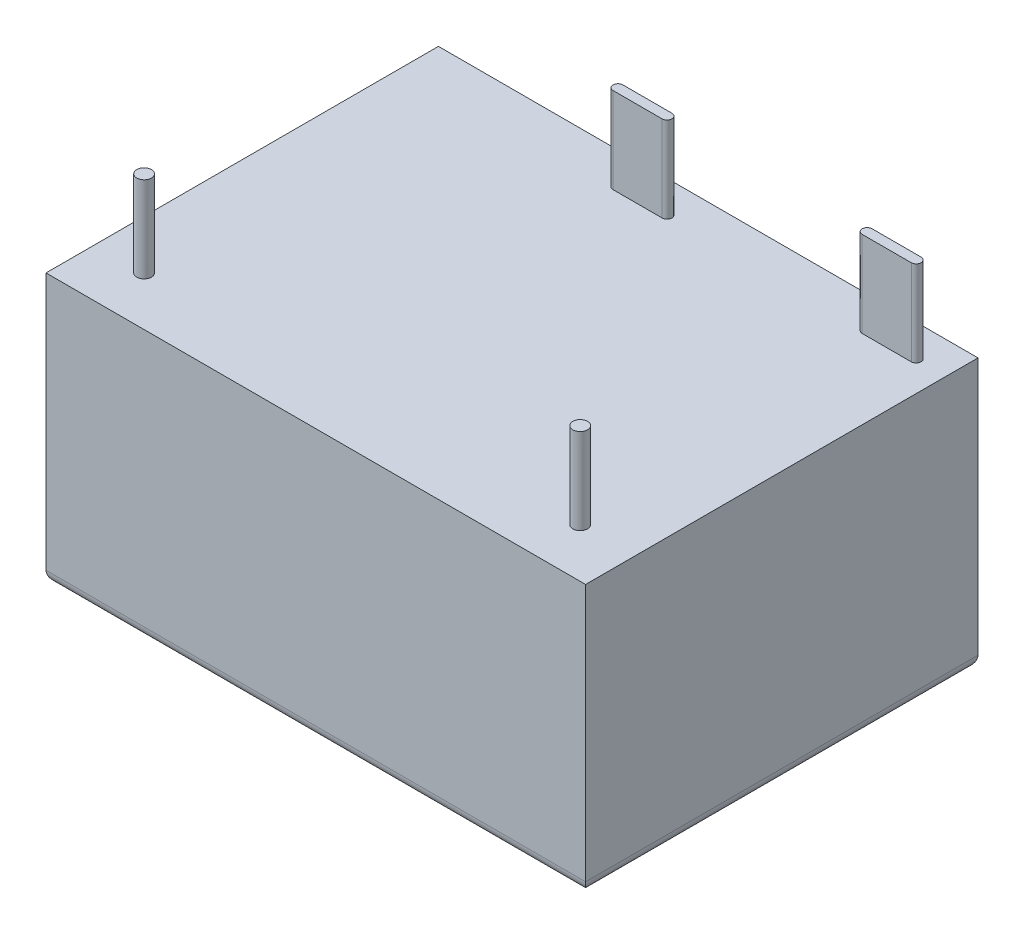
from build123d import *

# Parameters (mm, degrees)
SKETCH2_W           = 22
SKETCH2_H           = 16
BOSS_EXTRUDE1_DEPTH = 11
SKETCH3_R           = 0.3
BOSS_EXTRUDE2_DEPTH = 3.5
BOSS_EXTRUDE3_DEPTH = 3.5
FILLET2_R           = 0.5


with BuildPart() as part:
    # Sketch2 → Boss-Extrude1 (new body)
    with BuildSketch(Plane(origin=(0, 0, 0), x_dir=(1, 0, 0), z_dir=(0, 1, 0))):
        with Locations((11, 8)):
            Rectangle(SKETCH2_W, SKETCH2_H)
    extrude(amount=BOSS_EXTRUDE1_DEPTH)

    # Sketch3 → Boss-Extrude2 (add)
    with BuildSketch(Plane(origin=(0, 11, 0), x_dir=(1, 0, 0), z_dir=(0, 1, 0))):
        with Locations(Location((2, 2, 0), (0, 0, 90))):
            Circle(SKETCH3_R)
        with Locations(Location((19.78, 2, 0), (0, 0, 90))):
            Circle(SKETCH3_R)
    extrude(amount=BOSS_EXTRUDE2_DEPTH)

    # Sketch4 → Boss-Extrude3 (add)
    with BuildSketch(Plane(origin=(0, 11, 0), x_dir=(1, 0, 0), z_dir=(0, 1, 0))):
        with BuildLine():
            Line((20.78, 14.5), (18.78, 14.5))
            ThreePointArc((18.78, 14.5), (18.58, 14.7), (18.78, 14.9))
            Line((18.78, 14.9), (20.78, 14.9))
            ThreePointArc((20.78, 14.9), (20.98, 14.7), (20.78, 14.5))
        make_face()
        with BuildLine():
            Line((10.62, 14.5), (8.62, 14.5))
            ThreePointArc((8.62, 14.5), (8.42, 14.7), (8.62, 14.9))
            Line((8.62, 14.9), (10.62, 14.9))
            ThreePointArc((10.62, 14.9), (10.82, 14.7), (10.62, 14.5))
        make_face()
    extrude(amount=BOSS_EXTRUDE3_DEPTH)

    # Fillet2
    fillet2_edges = [part.edges().sort_by_distance(p)[0] for p in [
        (11, 0, -16),
        (22, 0, -8),
        (11, 0, 0),
        (0, 0, -8),
    ]]
    fillet(fillet2_edges, radius=FILLET2_R)


solid = part.part
